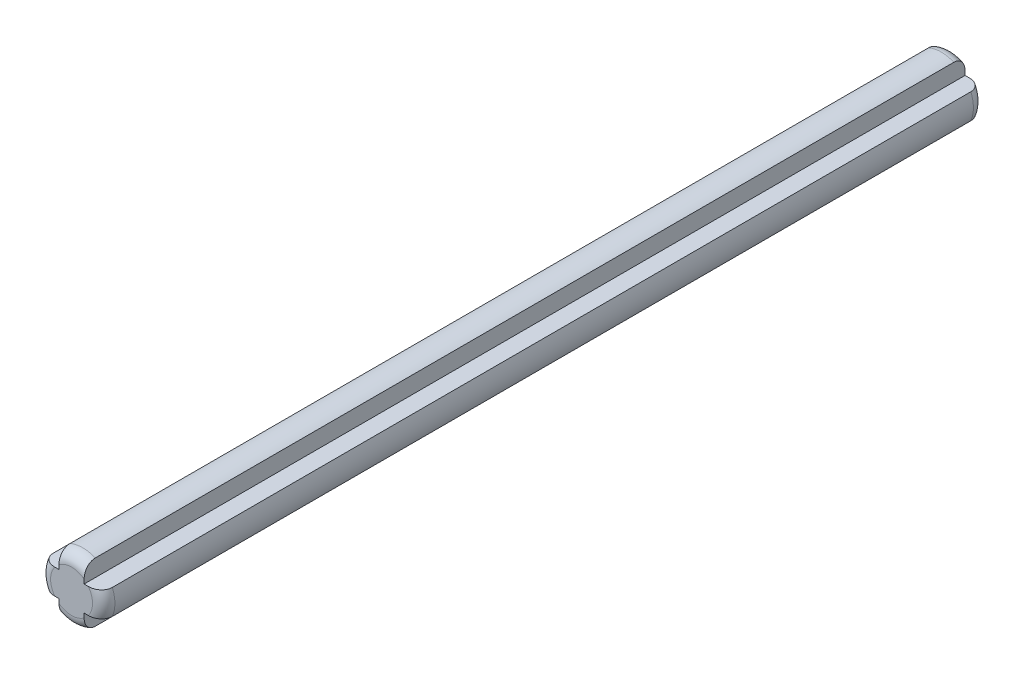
from build123d import *

# Parameters (mm, degrees)
BOSS_EXTRUDE1_DEPTH = 63
FILLET1_R           = 0.8


with BuildPart() as part:
    # Sketch1 → Boss-Extrude1 (new body)
    with BuildSketch(Plane.XY):
        with BuildLine():
            ThreePointArc((0.8999999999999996, 2.116601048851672), (1.4e-16, 2.3), (-0.8999999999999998, 2.116601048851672))
            Line((-0.8999999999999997, 2.1166010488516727), (-0.8999999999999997, 0.8999999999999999))
            Line((-0.8999999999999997, 0.9), (-2.116601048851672, 0.9))
            ThreePointArc((-2.116601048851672, 0.8999999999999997), (-2.3, 2.8e-16), (-2.1166010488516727, -0.8999999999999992))
            Line((-2.116601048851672, -0.9), (-0.8999999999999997, -0.9))
            Line((-0.8999999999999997, -0.8999999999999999), (-0.8999999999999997, -2.1166010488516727))
            ThreePointArc((-0.8999999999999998, -2.116601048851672), (-4.2e-16, -2.3), (0.899999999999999, -2.1166010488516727))
            Line((0.8999999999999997, -2.1166010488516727), (0.8999999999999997, -0.8999999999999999))
            Line((0.8999999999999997, -0.9), (2.116601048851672, -0.9))
            ThreePointArc((2.116601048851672, -0.9), (2.253683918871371, -0.4592480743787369), (2.3, -5.6e-16))
            ThreePointArc((2.3, 0), (2.2536839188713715, 0.4592480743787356), (2.116601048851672, 0.9))
            Line((2.116601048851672, 0.9), (0.8999999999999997, 0.9))
            Line((0.8999999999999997, 0.8999999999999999), (0.8999999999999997, 2.1166010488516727))
        make_face()
    extrude(amount=-BOSS_EXTRUDE1_DEPTH)

    # Fillet1
    fillet1_edges = [part.edges().sort_by_distance(p)[0] for p in [
        (-3.3e-16, 2.3, -63),
        (2.3, -3e-17, 0),
        (-5.3e-16, -2.3000000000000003, 0),
        (-2.3000000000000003, 5.8e-16, 0),
        (-3.3e-16, 2.3, 0),
        (-2.3000000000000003, 5.8e-16, -63),
        (-5.3e-16, -2.3000000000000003, -63),
        (2.3000000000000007, 7e-17, -63),
    ]]
    fillet(fillet1_edges, radius=FILLET1_R)


solid = part.part
